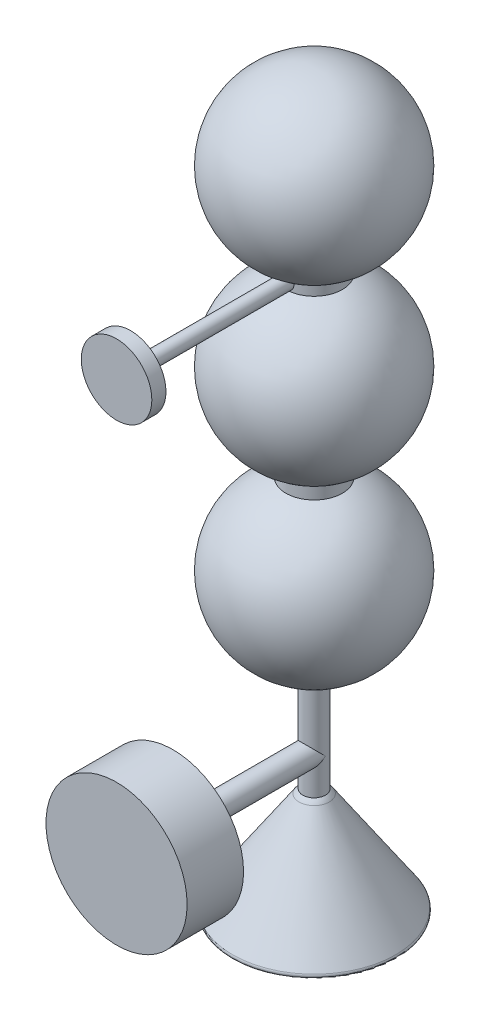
ISO-10303-21;
HEADER;
FILE_DESCRIPTION(('STEP AP214'),'2;1');
FILE_NAME('part.step','',(''),(''),'','','');
FILE_SCHEMA(('AUTOMOTIVE_DESIGN { 1 0 10303 214 1 1 1 1 }'));
ENDSEC;
DATA;
#1=APPLICATION_CONTEXT('core data for automotive mechanical design processes');
#2=APPLICATION_PROTOCOL_DEFINITION('international standard','automotive_design',2000,#1);
#3=PRODUCT_CONTEXT('',#1,'mechanical');
#4=PRODUCT('Part','Part','',(#3));
#5=PRODUCT_RELATED_PRODUCT_CATEGORY('part','',(#4));
#6=PRODUCT_DEFINITION_FORMATION('','',#4);
#7=PRODUCT_DEFINITION_CONTEXT('part definition',#1,'design');
#8=PRODUCT_DEFINITION('design','',#6,#7);
#9=PRODUCT_DEFINITION_SHAPE('','',#8);
#10=(LENGTH_UNIT() NAMED_UNIT(*) SI_UNIT(.MILLI.,.METRE.));
#11=(NAMED_UNIT(*) PLANE_ANGLE_UNIT() SI_UNIT($,.RADIAN.));
#12=(NAMED_UNIT(*) SI_UNIT($,.STERADIAN.) SOLID_ANGLE_UNIT());
#13=UNCERTAINTY_MEASURE_WITH_UNIT(LENGTH_MEASURE(1.E-05),#10,'distance_accuracy_value','');
#14=(GEOMETRIC_REPRESENTATION_CONTEXT(3) GLOBAL_UNCERTAINTY_ASSIGNED_CONTEXT((#13)) GLOBAL_UNIT_ASSIGNED_CONTEXT((#10,
#11,#12)) REPRESENTATION_CONTEXT('',''));
#15=CARTESIAN_POINT('',(0.,0.,0.));
#16=DIRECTION('',(0.,0.,1.));
#17=DIRECTION('',(1.,0.,0.));
#18=AXIS2_PLACEMENT_3D('',#15,#16,#17);
#19=CARTESIAN_POINT('',(0.,0.,0.));
#20=DIRECTION('',(0.,1.,0.));
#21=DIRECTION('',(0.,0.,1.));
#22=AXIS2_PLACEMENT_3D('',#19,#20,#21);
#23=PLANE('',#22);
#24=CARTESIAN_POINT('',(0.,0.,0.));
#25=DIRECTION('',(0.,1.,0.));
#26=DIRECTION('',(0.,0.,1.));
#27=AXIS2_PLACEMENT_3D('',#24,#25,#26);
#28=CIRCLE('',#27,56.2385470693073);
#29=CARTESIAN_POINT('',(0.,0.,56.2385470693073));
#30=VERTEX_POINT('',#29);
#31=EDGE_CURVE('E48',#30,#30,#28,.F.);
#32=ORIENTED_EDGE('',*,*,#31,.T.);
#33=EDGE_LOOP('',(#32));
#34=FACE_BOUND('',#33,.T.);
#35=ADVANCED_FACE('F41',(#34),#23,.F.);
#36=CARTESIAN_POINT('',(0.,73.1618819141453,0.));
#37=DIRECTION('',(0.,-1.,0.));
#38=DIRECTION('',(0.,0.,-1.));
#39=AXIS2_PLACEMENT_3D('',#36,#37,#38);
#40=CONICAL_SURFACE('',#39,10.6516875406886,0.593411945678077);
#41=CARTESIAN_POINT('',(0.,3.1183858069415,0.));
#42=DIRECTION('',(0.,1.,0.));
#43=DIRECTION('',(0.,0.,1.));
#44=AXIS2_PLACEMENT_3D('',#41,#42,#43);
#45=CIRCLE('',#44,57.8966222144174);
#46=CARTESIAN_POINT('',(0.,3.11838580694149,-57.8966222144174));
#47=VERTEX_POINT('',#46);
#48=EDGE_CURVE('E12',#47,#47,#45,.T.);
#49=CARTESIAN_POINT('',(0.,73.1618819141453,0.));
#50=DIRECTION('',(0.,-1.,0.));
#51=DIRECTION('',(0.,0.,-1.));
#52=AXIS2_PLACEMENT_3D('',#49,#50,#51);
#53=CIRCLE('',#52,10.6516875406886);
#54=CARTESIAN_POINT('',(0.,73.1618819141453,-10.6516875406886));
#55=VERTEX_POINT('',#54);
#56=EDGE_CURVE('E71',#55,#55,#53,.T.);
#57=CARTESIAN_POINT('',(0.,3.11838580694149,-57.8966222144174));
#58=CARTESIAN_POINT('',(0.,3.84800555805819,-57.4044874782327));
#59=CARTESIAN_POINT('',(0.,4.5776253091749,-56.912352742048));
#60=CARTESIAN_POINT('',(0.,6.03686481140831,-55.9280832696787));
#61=CARTESIAN_POINT('',(0.,6.76648456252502,-55.435948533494));
#62=CARTESIAN_POINT('',(0.,8.22572406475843,-54.4516790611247));
#63=CARTESIAN_POINT('',(0.,8.95534381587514,-53.95954432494));
#64=CARTESIAN_POINT('',(0.,10.4145833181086,-52.9752748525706));
#65=CARTESIAN_POINT('',(0.,11.1442030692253,-52.483140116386));
#66=CARTESIAN_POINT('',(0.,12.6034425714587,-51.4988706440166));
#67=CARTESIAN_POINT('',(0.,13.3330623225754,-51.0067359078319));
#68=CARTESIAN_POINT('',(0.,14.7923018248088,-50.0224664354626));
#69=CARTESIAN_POINT('',(0.,15.5219215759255,-49.5303316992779));
#70=CARTESIAN_POINT('',(0.,16.9811610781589,-48.5460622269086));
#71=CARTESIAN_POINT('',(0.,17.7107808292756,-48.0539274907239));
#72=CARTESIAN_POINT('',(0.,19.170020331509,-47.0696580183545));
#73=CARTESIAN_POINT('',(0.,19.8996400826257,-46.5775232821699));
#74=CARTESIAN_POINT('',(0.,21.3588795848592,-45.5932538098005));
#75=CARTESIAN_POINT('',(0.,22.0884993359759,-45.1011190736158));
#76=CARTESIAN_POINT('',(0.,23.5477388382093,-44.1168496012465));
#77=CARTESIAN_POINT('',(0.,24.277358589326,-43.6247148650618));
#78=CARTESIAN_POINT('',(0.,25.7365980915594,-42.6404453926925));
#79=CARTESIAN_POINT('',(0.,26.4662178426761,-42.1483106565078));
#80=CARTESIAN_POINT('',(0.,27.9254573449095,-41.1640411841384));
#81=CARTESIAN_POINT('',(0.,28.6550770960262,-40.6719064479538));
#82=CARTESIAN_POINT('',(0.,30.1143165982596,-39.6876369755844));
#83=CARTESIAN_POINT('',(0.,30.8439363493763,-39.1955022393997));
#84=CARTESIAN_POINT('',(0.,32.3031758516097,-38.2112327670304));
#85=CARTESIAN_POINT('',(0.,33.0327956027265,-37.7190980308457));
#86=CARTESIAN_POINT('',(0.,34.4920351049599,-36.7348285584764));
#87=CARTESIAN_POINT('',(0.,35.2216548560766,-36.2426938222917));
#88=CARTESIAN_POINT('',(0.,36.68089435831,-35.2584243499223));
#89=CARTESIAN_POINT('',(0.,37.4105141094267,-34.7662896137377));
#90=CARTESIAN_POINT('',(0.,38.8697536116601,-33.7820201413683));
#91=CARTESIAN_POINT('',(0.,39.5993733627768,-33.2898854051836));
#92=CARTESIAN_POINT('',(0.,41.0586128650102,-32.3056159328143));
#93=CARTESIAN_POINT('',(0.,41.7882326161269,-31.8134811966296));
#94=CARTESIAN_POINT('',(0.,43.2474721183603,-30.8292117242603));
#95=CARTESIAN_POINT('',(0.,43.9770918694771,-30.3370769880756));
#96=CARTESIAN_POINT('',(0.,45.4363313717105,-29.3528075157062));
#97=CARTESIAN_POINT('',(0.,46.1659511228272,-28.8606727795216));
#98=CARTESIAN_POINT('',(0.,47.6251906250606,-27.8764033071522));
#99=CARTESIAN_POINT('',(0.,48.3548103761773,-27.3842685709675));
#100=CARTESIAN_POINT('',(0.,49.8140498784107,-26.3999990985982));
#101=CARTESIAN_POINT('',(0.,50.5436696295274,-25.9078643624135));
#102=CARTESIAN_POINT('',(0.,52.0029091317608,-24.9235948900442));
#103=CARTESIAN_POINT('',(0.,52.7325288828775,-24.4314601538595));
#104=CARTESIAN_POINT('',(0.,54.1917683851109,-23.4471906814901));
#105=CARTESIAN_POINT('',(0.,54.9213881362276,-22.9550559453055));
#106=CARTESIAN_POINT('',(0.,56.3806276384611,-21.9707864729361));
#107=CARTESIAN_POINT('',(0.,57.1102473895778,-21.4786517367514));
#108=CARTESIAN_POINT('',(0.,58.5694868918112,-20.4943822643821));
#109=CARTESIAN_POINT('',(0.,59.2991066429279,-20.0022475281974));
#110=CARTESIAN_POINT('',(0.,60.7583461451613,-19.0179780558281));
#111=CARTESIAN_POINT('',(0.,61.487965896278,-18.5258433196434));
#112=CARTESIAN_POINT('',(0.,62.9472053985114,-17.541573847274));
#113=CARTESIAN_POINT('',(0.,63.6768251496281,-17.0494391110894));
#114=CARTESIAN_POINT('',(0.,65.1360646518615,-16.06516963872));
#115=CARTESIAN_POINT('',(0.,65.8656844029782,-15.5730349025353));
#116=CARTESIAN_POINT('',(0.,67.3249239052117,-14.588765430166));
#117=CARTESIAN_POINT('',(0.,68.0545436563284,-14.0966306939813));
#118=CARTESIAN_POINT('',(0.,69.5137831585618,-13.112361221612));
#119=CARTESIAN_POINT('',(0.,70.2434029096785,-12.6202264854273));
#120=CARTESIAN_POINT('',(0.,71.7026424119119,-11.6359570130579));
#121=CARTESIAN_POINT('',(0.,72.4322621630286,-11.1438222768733));
#122=CARTESIAN_POINT('',(0.,73.1618819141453,-10.6516875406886));
#123=B_SPLINE_CURVE_WITH_KNOTS('',3,(#57,#58,#59,#60,#61,#62,#63,#64,#65,#66,#67,#68,#69,#70,
#71,#72,#73,#74,#75,#76,#77,#78,#79,#80,#81,#82,#83,#84,#85,#86,#87,#88,#89,#90,#91,#92,#93,#94,
#95,#96,#97,#98,#99,#100,#101,#102,#103,#104,#105,#106,#107,#108,#109,#110,#111,#112,#113,#114,
#115,#116,#117,#118,#119,#120,#121,#122),.UNSPECIFIED.,.F.,.F.,(4,2,2,2,2,2,2,2,2,2,2,2,2,2,2,2,
2,2,2,2,2,2,2,2,2,2,2,2,2,2,2,2,4),(0.,2.64024131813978,5.28048263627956,7.92072395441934,
10.5609652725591,13.2012065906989,15.8414479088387,18.4816892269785,21.1219305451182,
23.762171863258,26.4024131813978,29.0426544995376,31.6828958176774,34.3231371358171,
36.9633784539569,39.6036197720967,42.2438610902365,44.8841024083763,47.524343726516,
50.1645850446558,52.8048263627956,55.4450676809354,58.0853089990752,60.7255503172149,
63.3657916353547,66.0060329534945,68.6462742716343,71.286515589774,73.9267569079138,
76.5669982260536,79.2072395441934,81.8474808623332,84.4877221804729),.UNSPECIFIED.);
#124=EDGE_CURVE('BSEAM53',#47,#55,#123,.T.);
#125=ORIENTED_EDGE('',*,*,#48,.T.);
#126=ORIENTED_EDGE('',*,*,#56,.T.);
#127=ORIENTED_EDGE('',*,*,#124,.T.);
#128=ORIENTED_EDGE('',*,*,#124,.F.);
#129=EDGE_LOOP('',(#125,#127,#126,#128));
#130=FACE_BOUND('',#129,.T.);
#131=ADVANCED_FACE('F53',(#130),#40,.T.);
#132=CARTESIAN_POINT('',(0.,64.2147954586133,2.61291362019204));
#133=DIRECTION('',(-1.,0.,0.));
#134=DIRECTION('',(0.,0.,-1.));
#135=AXIS2_PLACEMENT_3D('',#132,#133,#134);
#136=CIRCLE('',#135,16.);
#137=TRIMMED_CURVE('',#136,(PARAMETER_VALUE(-1.40675449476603)),
(PARAMETER_VALUE(1.40675449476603)),.T.,.PARAMETER.);
#138=CARTESIAN_POINT('',(0.,64.2147954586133,0.));
#139=DIRECTION('',(0.,-1.,0.));
#140=AXIS1_PLACEMENT('',#138,#139);
#141=SURFACE_OF_REVOLUTION('',#137,#140);
#142=ORIENTED_EDGE('',*,*,#56,.F.);
#143=EDGE_LOOP('',(#142));
#144=FACE_BOUND('',#143,.T.);
#145=CARTESIAN_POINT('',(0.,80.,0.));
#146=VERTEX_POINT('',#145);
#147=VERTEX_LOOP('',#146);
#148=FACE_BOUND('',#147,.T.);
#149=ADVANCED_FACE('F51',(#144,#148),#141,.T.);
#150=CARTESIAN_POINT('',(0.,2.,0.));
#151=DIRECTION('',(0.,1.,0.));
#152=DIRECTION('',(0.,0.,1.));
#153=AXIS2_PLACEMENT_3D('',#150,#151,#152);
#154=TOROIDAL_SURFACE('',#153,56.2385470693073,2.);
#155=ORIENTED_EDGE('',*,*,#48,.F.);
#156=EDGE_LOOP('',(#155));
#157=FACE_BOUND('',#156,.T.);
#158=ORIENTED_EDGE('',*,*,#31,.F.);
#159=EDGE_LOOP('',(#158));
#160=FACE_BOUND('',#159,.T.);
#161=ADVANCED_FACE('F43',(#157,#160),#154,.T.);
#162=CLOSED_SHELL('',(#35,#131,#149,#161));
#163=MANIFOLD_SOLID_BREP('B2',#162);
#164=CARTESIAN_POINT('',(0.,397.116670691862,140.));
#165=DIRECTION('',(0.,0.,-1.));
#166=DIRECTION('',(-1.,0.,0.));
#167=AXIS2_PLACEMENT_3D('',#164,#165,#166);
#168=CYLINDRICAL_SURFACE('',#167,25.);
#169=CARTESIAN_POINT('',(0.,397.116670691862,140.));
#170=DIRECTION('',(0.,0.,1.));
#171=DIRECTION('',(1.,0.,0.));
#172=AXIS2_PLACEMENT_3D('',#169,#170,#171);
#173=CIRCLE('',#172,25.);
#174=CARTESIAN_POINT('',(25.,397.116670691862,140.));
#175=VERTEX_POINT('',#174);
#176=EDGE_CURVE('E40',#175,#175,#173,.T.);
#177=ORIENTED_EDGE('',*,*,#176,.F.);
#178=EDGE_LOOP('',(#177));
#179=FACE_BOUND('',#178,.T.);
#180=CARTESIAN_POINT('',(0.,397.116670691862,130.));
#181=DIRECTION('',(0.,0.,1.));
#182=DIRECTION('',(1.,0.,0.));
#183=AXIS2_PLACEMENT_3D('',#180,#181,#182);
#184=CIRCLE('',#183,25.);
#185=CARTESIAN_POINT('',(25.,397.116670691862,130.));
#186=VERTEX_POINT('',#185);
#187=EDGE_CURVE('E109',#186,#186,#184,.T.);
#188=ORIENTED_EDGE('',*,*,#187,.T.);
#189=EDGE_LOOP('',(#188));
#190=FACE_BOUND('',#189,.T.);
#191=ADVANCED_FACE('F106',(#179,#190),#168,.T.);
#192=CARTESIAN_POINT('',(0.,397.116670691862,140.));
#193=DIRECTION('',(0.,0.,1.));
#194=DIRECTION('',(1.,0.,0.));
#195=AXIS2_PLACEMENT_3D('',#192,#193,#194);
#196=PLANE('',#195);
#197=ORIENTED_EDGE('',*,*,#176,.T.);
#198=EDGE_LOOP('',(#197));
#199=FACE_BOUND('',#198,.T.);
#200=ADVANCED_FACE('F121',(#199),#196,.T.);
#201=CARTESIAN_POINT('',(0.,397.116670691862,130.));
#202=DIRECTION('',(0.,0.,1.));
#203=DIRECTION('',(1.,0.,0.));
#204=AXIS2_PLACEMENT_3D('',#201,#202,#203);
#205=PLANE('',#204);
#206=ORIENTED_EDGE('',*,*,#187,.F.);
#207=EDGE_LOOP('',(#206));
#208=FACE_BOUND('',#207,.T.);
#209=ADVANCED_FACE('F119',(#208),#205,.F.);
#210=CLOSED_SHELL('',(#191,#200,#209));
#211=MANIFOLD_SOLID_BREP('B6',#210);
#212=CARTESIAN_POINT('',(0.,397.116670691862,130.));
#213=DIRECTION('',(0.,0.,-1.));
#214=DIRECTION('',(-1.,0.,0.));
#215=AXIS2_PLACEMENT_3D('',#212,#213,#214);
#216=CYLINDRICAL_SURFACE('',#215,5.00000000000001);
#217=CARTESIAN_POINT('',(0.,397.116670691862,130.));
#218=DIRECTION('',(0.,0.,1.));
#219=DIRECTION('',(1.,0.,0.));
#220=AXIS2_PLACEMENT_3D('',#217,#218,#219);
#221=CIRCLE('',#220,5.00000000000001);
#222=CARTESIAN_POINT('',(5.00000000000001,397.116670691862,130.));
#223=VERTEX_POINT('',#222);
#224=EDGE_CURVE('E105',#223,#223,#221,.T.);
#225=ORIENTED_EDGE('',*,*,#224,.F.);
#226=EDGE_LOOP('',(#225));
#227=FACE_BOUND('',#226,.T.);
#228=CARTESIAN_POINT('',(0.,397.116670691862,0.));
#229=DIRECTION('',(0.,0.,1.));
#230=DIRECTION('',(1.,0.,0.));
#231=AXIS2_PLACEMENT_3D('',#228,#229,#230);
#232=CIRCLE('',#231,5.00000000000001);
#233=CARTESIAN_POINT('',(5.00000000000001,397.116670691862,0.));
#234=VERTEX_POINT('',#233);
#235=EDGE_CURVE('E157',#234,#234,#232,.T.);
#236=ORIENTED_EDGE('',*,*,#235,.T.);
#237=EDGE_LOOP('',(#236));
#238=FACE_BOUND('',#237,.T.);
#239=ADVANCED_FACE('F154',(#227,#238),#216,.T.);
#240=CARTESIAN_POINT('',(0.,397.116670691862,130.));
#241=DIRECTION('',(0.,0.,1.));
#242=DIRECTION('',(1.,0.,0.));
#243=AXIS2_PLACEMENT_3D('',#240,#241,#242);
#244=PLANE('',#243);
#245=ORIENTED_EDGE('',*,*,#224,.T.);
#246=EDGE_LOOP('',(#245));
#247=FACE_BOUND('',#246,.T.);
#248=ADVANCED_FACE('F169',(#247),#244,.T.);
#249=CARTESIAN_POINT('',(0.,397.116670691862,0.));
#250=DIRECTION('',(0.,0.,1.));
#251=DIRECTION('',(1.,0.,0.));
#252=AXIS2_PLACEMENT_3D('',#249,#250,#251);
#253=PLANE('',#252);
#254=ORIENTED_EDGE('',*,*,#235,.F.);
#255=EDGE_LOOP('',(#254));
#256=FACE_BOUND('',#255,.T.);
#257=ADVANCED_FACE('F167',(#256),#253,.F.);
#258=CLOSED_SHELL('',(#239,#248,#257));
#259=MANIFOLD_SOLID_BREP('B35',#258);
#260=CARTESIAN_POINT('',(0.,100.,140.));
#261=DIRECTION('',(0.,0.,-1.));
#262=DIRECTION('',(-1.,0.,0.));
#263=AXIS2_PLACEMENT_3D('',#260,#261,#262);
#264=CYLINDRICAL_SURFACE('',#263,50.);
#265=CARTESIAN_POINT('',(0.,100.,140.));
#266=DIRECTION('',(0.,0.,1.));
#267=DIRECTION('',(1.,0.,0.));
#268=AXIS2_PLACEMENT_3D('',#265,#266,#267);
#269=CIRCLE('',#268,50.);
#270=CARTESIAN_POINT('',(50.,100.,140.));
#271=VERTEX_POINT('',#270);
#272=EDGE_CURVE('E153',#271,#271,#269,.T.);
#273=ORIENTED_EDGE('',*,*,#272,.F.);
#274=EDGE_LOOP('',(#273));
#275=FACE_BOUND('',#274,.T.);
#276=CARTESIAN_POINT('',(0.,100.,100.));
#277=DIRECTION('',(0.,0.,1.));
#278=DIRECTION('',(1.,0.,0.));
#279=AXIS2_PLACEMENT_3D('',#276,#277,#278);
#280=CIRCLE('',#279,50.);
#281=CARTESIAN_POINT('',(50.,100.,100.));
#282=VERTEX_POINT('',#281);
#283=EDGE_CURVE('E203',#282,#282,#280,.T.);
#284=ORIENTED_EDGE('',*,*,#283,.T.);
#285=EDGE_LOOP('',(#284));
#286=FACE_BOUND('',#285,.T.);
#287=ADVANCED_FACE('F200',(#275,#286),#264,.T.);
#288=CARTESIAN_POINT('',(0.,100.,140.));
#289=DIRECTION('',(0.,0.,1.));
#290=DIRECTION('',(1.,0.,0.));
#291=AXIS2_PLACEMENT_3D('',#288,#289,#290);
#292=PLANE('',#291);
#293=ORIENTED_EDGE('',*,*,#272,.T.);
#294=EDGE_LOOP('',(#293));
#295=FACE_BOUND('',#294,.T.);
#296=ADVANCED_FACE('F215',(#295),#292,.T.);
#297=CARTESIAN_POINT('',(0.,100.,100.));
#298=DIRECTION('',(0.,0.,1.));
#299=DIRECTION('',(1.,0.,0.));
#300=AXIS2_PLACEMENT_3D('',#297,#298,#299);
#301=PLANE('',#300);
#302=ORIENTED_EDGE('',*,*,#283,.F.);
#303=EDGE_LOOP('',(#302));
#304=FACE_BOUND('',#303,.T.);
#305=ADVANCED_FACE('F213',(#304),#301,.F.);
#306=CLOSED_SHELL('',(#287,#296,#305));
#307=MANIFOLD_SOLID_BREP('B100',#306);
#308=CARTESIAN_POINT('',(0.,458.290277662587,0.));
#309=DIRECTION('',(0.,-1.,0.));
#310=DIRECTION('',(-1.,0.,0.));
#311=AXIS2_PLACEMENT_3D('',#308,#309,#310);
#312=SPHERICAL_SURFACE('',#311,60.);
#313=CARTESIAN_POINT('',(0.,398.290277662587,0.));
#314=VERTEX_POINT('',#313);
#315=VERTEX_LOOP('',#314);
#316=FACE_BOUND('',#315,.T.);
#317=ADVANCED_FACE('F248',(#316),#312,.T.);
#318=CLOSED_SHELL('',(#317));
#319=MANIFOLD_SOLID_BREP('B148',#318);
#320=CARTESIAN_POINT('',(0.,392.298188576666,0.));
#321=DIRECTION('',(0.,1.,0.));
#322=DIRECTION('',(0.,0.,1.));
#323=AXIS2_PLACEMENT_3D('',#320,#321,#322);
#324=PLANE('',#323);
#325=CARTESIAN_POINT('',(0.,392.298188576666,0.));
#326=DIRECTION('',(0.,-1.,0.));
#327=DIRECTION('',(0.,0.,-1.));
#328=AXIS2_PLACEMENT_3D('',#325,#326,#327);
#329=CIRCLE('',#328,20.);
#330=CARTESIAN_POINT('',(0.,392.298188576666,-20.));
#331=VERTEX_POINT('',#330);
#332=EDGE_CURVE('E247',#331,#331,#329,.T.);
#333=ORIENTED_EDGE('',*,*,#332,.T.);
#334=EDGE_LOOP('',(#333));
#335=FACE_BOUND('',#334,.T.);
#336=ADVANCED_FACE('F266',(#335),#324,.F.);
#337=CARTESIAN_POINT('',(0.,378.613765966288,0.));
#338=DIRECTION('',(0.,-1.,0.));
#339=DIRECTION('',(0.,0.,-1.));
#340=AXIS2_PLACEMENT_3D('',#337,#338,#339);
#341=CYLINDRICAL_SURFACE('',#340,20.);
#342=ORIENTED_EDGE('',*,*,#332,.F.);
#343=EDGE_LOOP('',(#342));
#344=FACE_BOUND('',#343,.T.);
#345=CARTESIAN_POINT('',(0.,402.298188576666,0.));
#346=DIRECTION('',(0.,-1.,0.));
#347=DIRECTION('',(0.,0.,-1.));
#348=AXIS2_PLACEMENT_3D('',#345,#346,#347);
#349=CIRCLE('',#348,20.);
#350=CARTESIAN_POINT('',(0.,402.298188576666,-20.));
#351=VERTEX_POINT('',#350);
#352=EDGE_CURVE('E272',#351,#351,#349,.T.);
#353=ORIENTED_EDGE('',*,*,#352,.T.);
#354=EDGE_LOOP('',(#353));
#355=FACE_BOUND('',#354,.T.);
#356=ADVANCED_FACE('F278',(#344,#355),#341,.T.);
#357=CARTESIAN_POINT('',(0.,402.298188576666,0.));
#358=DIRECTION('',(0.,-1.,0.));
#359=DIRECTION('',(0.,0.,-1.));
#360=AXIS2_PLACEMENT_3D('',#357,#358,#359);
#361=PLANE('',#360);
#362=ORIENTED_EDGE('',*,*,#352,.F.);
#363=EDGE_LOOP('',(#362));
#364=FACE_BOUND('',#363,.T.);
#365=ADVANCED_FACE('F280',(#364),#361,.F.);
#366=CLOSED_SHELL('',(#336,#356,#365));
#367=MANIFOLD_SOLID_BREP('B196',#366);
#368=CARTESIAN_POINT('',(0.,335.,0.));
#369=DIRECTION('',(0.,1.,0.));
#370=DIRECTION('',(1.,0.,0.));
#371=AXIS2_PLACEMENT_3D('',#368,#369,#370);
#372=SPHERICAL_SURFACE('',#371,60.);
#373=CARTESIAN_POINT('',(0.,395.,0.));
#374=VERTEX_POINT('',#373);
#375=VERTEX_LOOP('',#374);
#376=FACE_BOUND('',#375,.T.);
#377=ADVANCED_FACE('F314',(#376),#372,.T.);
#378=CLOSED_SHELL('',(#377));
#379=MANIFOLD_SOLID_BREP('B242',#378);
#380=CARTESIAN_POINT('',(0.,267.298188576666,0.));
#381=DIRECTION('',(0.,1.,0.));
#382=DIRECTION('',(0.,0.,1.));
#383=AXIS2_PLACEMENT_3D('',#380,#381,#382);
#384=PLANE('',#383);
#385=CARTESIAN_POINT('',(0.,267.298188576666,0.));
#386=DIRECTION('',(0.,-1.,0.));
#387=DIRECTION('',(0.,0.,-1.));
#388=AXIS2_PLACEMENT_3D('',#385,#386,#387);
#389=CIRCLE('',#388,20.);
#390=CARTESIAN_POINT('',(0.,267.298188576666,-20.));
#391=VERTEX_POINT('',#390);
#392=EDGE_CURVE('E313',#391,#391,#389,.T.);
#393=ORIENTED_EDGE('',*,*,#392,.T.);
#394=EDGE_LOOP('',(#393));
#395=FACE_BOUND('',#394,.T.);
#396=ADVANCED_FACE('F332',(#395),#384,.F.);
#397=CARTESIAN_POINT('',(0.,253.613765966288,0.));
#398=DIRECTION('',(0.,-1.,0.));
#399=DIRECTION('',(0.,0.,-1.));
#400=AXIS2_PLACEMENT_3D('',#397,#398,#399);
#401=CYLINDRICAL_SURFACE('',#400,20.);
#402=ORIENTED_EDGE('',*,*,#392,.F.);
#403=EDGE_LOOP('',(#402));
#404=FACE_BOUND('',#403,.T.);
#405=CARTESIAN_POINT('',(0.,277.298188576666,0.));
#406=DIRECTION('',(0.,-1.,0.));
#407=DIRECTION('',(0.,0.,-1.));
#408=AXIS2_PLACEMENT_3D('',#405,#406,#407);
#409=CIRCLE('',#408,20.);
#410=CARTESIAN_POINT('',(0.,277.298188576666,-20.));
#411=VERTEX_POINT('',#410);
#412=EDGE_CURVE('E338',#411,#411,#409,.T.);
#413=ORIENTED_EDGE('',*,*,#412,.T.);
#414=EDGE_LOOP('',(#413));
#415=FACE_BOUND('',#414,.T.);
#416=ADVANCED_FACE('F344',(#404,#415),#401,.T.);
#417=CARTESIAN_POINT('',(0.,277.298188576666,0.));
#418=DIRECTION('',(0.,-1.,0.));
#419=DIRECTION('',(0.,0.,-1.));
#420=AXIS2_PLACEMENT_3D('',#417,#418,#419);
#421=PLANE('',#420);
#422=ORIENTED_EDGE('',*,*,#412,.F.);
#423=EDGE_LOOP('',(#422));
#424=FACE_BOUND('',#423,.T.);
#425=ADVANCED_FACE('F346',(#424),#421,.F.);
#426=CLOSED_SHELL('',(#396,#416,#425));
#427=MANIFOLD_SOLID_BREP('B262',#426);
#428=CARTESIAN_POINT('',(0.,210.,0.));
#429=DIRECTION('',(0.,1.,0.));
#430=DIRECTION('',(1.,0.,0.));
#431=AXIS2_PLACEMENT_3D('',#428,#429,#430);
#432=SPHERICAL_SURFACE('',#431,60.);
#433=CARTESIAN_POINT('',(0.,270.,0.));
#434=VERTEX_POINT('',#433);
#435=VERTEX_LOOP('',#434);
#436=FACE_BOUND('',#435,.T.);
#437=ADVANCED_FACE('F381',(#436),#432,.T.);
#438=CLOSED_SHELL('',(#437));
#439=MANIFOLD_SOLID_BREP('B308',#438);
#440=CARTESIAN_POINT('',(0.,150.,0.));
#441=DIRECTION('',(0.,-1.,0.));
#442=DIRECTION('',(0.,0.,-1.));
#443=AXIS2_PLACEMENT_3D('',#440,#441,#442);
#444=CYLINDRICAL_SURFACE('',#443,8.);
#445=CARTESIAN_POINT('',(0.,0.,0.));
#446=DIRECTION('',(0.,1.,0.));
#447=DIRECTION('',(0.,0.,1.));
#448=AXIS2_PLACEMENT_3D('',#445,#446,#447);
#449=CIRCLE('',#448,8.);
#450=CARTESIAN_POINT('',(0.,0.,8.));
#451=VERTEX_POINT('',#450);
#452=EDGE_CURVE('E410',#451,#451,#449,.T.);
#453=ORIENTED_EDGE('',*,*,#452,.T.);
#454=EDGE_LOOP('',(#453));
#455=FACE_BOUND('',#454,.T.);
#456=CARTESIAN_POINT('',(0.,150.,0.));
#457=DIRECTION('',(0.,1.,0.));
#458=DIRECTION('',(0.,0.,1.));
#459=AXIS2_PLACEMENT_3D('',#456,#457,#458);
#460=CIRCLE('',#459,8.);
#461=CARTESIAN_POINT('',(0.,150.,8.));
#462=VERTEX_POINT('',#461);
#463=EDGE_CURVE('E408',#462,#462,#460,.T.);
#464=ORIENTED_EDGE('',*,*,#463,.F.);
#465=EDGE_LOOP('',(#464));
#466=FACE_BOUND('',#465,.T.);
#467=CARTESIAN_POINT('',(0.,100.,0.));
#468=DIRECTION('',(0.,-0.707106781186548,-0.707106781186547));
#469=DIRECTION('',(0.,-0.707106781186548,0.707106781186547));
#470=AXIS2_PLACEMENT_3D('',#467,#468,#469);
#471=ELLIPSE('',#470,11.3137084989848,8.);
#472=CARTESIAN_POINT('',(-8.,100.,0.));
#473=VERTEX_POINT('',#472);
#474=CARTESIAN_POINT('',(8.,100.,0.));
#475=VERTEX_POINT('',#474);
#476=EDGE_CURVE('E379',#473,#475,#471,.F.);
#477=ORIENTED_EDGE('',*,*,#476,.F.);
#478=CARTESIAN_POINT('',(0.,100.,0.));
#479=DIRECTION('',(0.,-0.707106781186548,0.707106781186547));
#480=DIRECTION('',(0.,-0.707106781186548,-0.707106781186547));
#481=AXIS2_PLACEMENT_3D('',#478,#479,#480);
#482=ELLIPSE('',#481,11.3137084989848,8.);
#483=EDGE_CURVE('E400',#475,#473,#482,.T.);
#484=ORIENTED_EDGE('',*,*,#483,.F.);
#485=EDGE_LOOP('',(#477,#484));
#486=FACE_BOUND('',#485,.T.);
#487=ADVANCED_FACE('F393',(#455,#466,#486),#444,.T.);
#488=CARTESIAN_POINT('',(0.,150.,0.));
#489=DIRECTION('',(0.,1.,0.));
#490=DIRECTION('',(0.,0.,1.));
#491=AXIS2_PLACEMENT_3D('',#488,#489,#490);
#492=PLANE('',#491);
#493=ORIENTED_EDGE('',*,*,#463,.T.);
#494=EDGE_LOOP('',(#493));
#495=FACE_BOUND('',#494,.T.);
#496=ADVANCED_FACE('F429',(#495),#492,.T.);
#497=CARTESIAN_POINT('',(0.,0.,0.));
#498=DIRECTION('',(0.,1.,0.));
#499=DIRECTION('',(0.,0.,1.));
#500=AXIS2_PLACEMENT_3D('',#497,#498,#499);
#501=PLANE('',#500);
#502=ORIENTED_EDGE('',*,*,#452,.F.);
#503=EDGE_LOOP('',(#502));
#504=FACE_BOUND('',#503,.T.);
#505=ADVANCED_FACE('F422',(#504),#501,.F.);
#506=CARTESIAN_POINT('',(0.,100.,100.));
#507=DIRECTION('',(0.,0.,-1.));
#508=DIRECTION('',(-1.,0.,0.));
#509=AXIS2_PLACEMENT_3D('',#506,#507,#508);
#510=CYLINDRICAL_SURFACE('',#509,8.);
#511=CARTESIAN_POINT('',(0.,100.,100.));
#512=DIRECTION('',(0.,0.,1.));
#513=DIRECTION('',(1.,0.,0.));
#514=AXIS2_PLACEMENT_3D('',#511,#512,#513);
#515=CIRCLE('',#514,8.);
#516=CARTESIAN_POINT('',(8.,100.,100.));
#517=VERTEX_POINT('',#516);
#518=EDGE_CURVE('E414',#517,#517,#515,.T.);
#519=ORIENTED_EDGE('',*,*,#518,.F.);
#520=EDGE_LOOP('',(#519));
#521=FACE_BOUND('',#520,.T.);
#522=ORIENTED_EDGE('',*,*,#483,.T.);
#523=ORIENTED_EDGE('',*,*,#476,.T.);
#524=EDGE_LOOP('',(#522,#523));
#525=FACE_BOUND('',#524,.T.);
#526=ADVANCED_FACE('F407',(#521,#525),#510,.T.);
#527=CARTESIAN_POINT('',(0.,100.,100.));
#528=DIRECTION('',(0.,0.,1.));
#529=DIRECTION('',(1.,0.,0.));
#530=AXIS2_PLACEMENT_3D('',#527,#528,#529);
#531=PLANE('',#530);
#532=ORIENTED_EDGE('',*,*,#518,.T.);
#533=EDGE_LOOP('',(#532));
#534=FACE_BOUND('',#533,.T.);
#535=ADVANCED_FACE('F419',(#534),#531,.T.);
#536=CLOSED_SHELL('',(#487,#496,#505,#526,#535));
#537=MANIFOLD_SOLID_BREP('B328',#536);
#538=ADVANCED_BREP_SHAPE_REPRESENTATION('',(#18,#163,#211,#259,#307,#319,#367,#379,#427,#439,
#537),#14);
#539=SHAPE_DEFINITION_REPRESENTATION(#9,#538);
ENDSEC;
END-ISO-10303-21;
